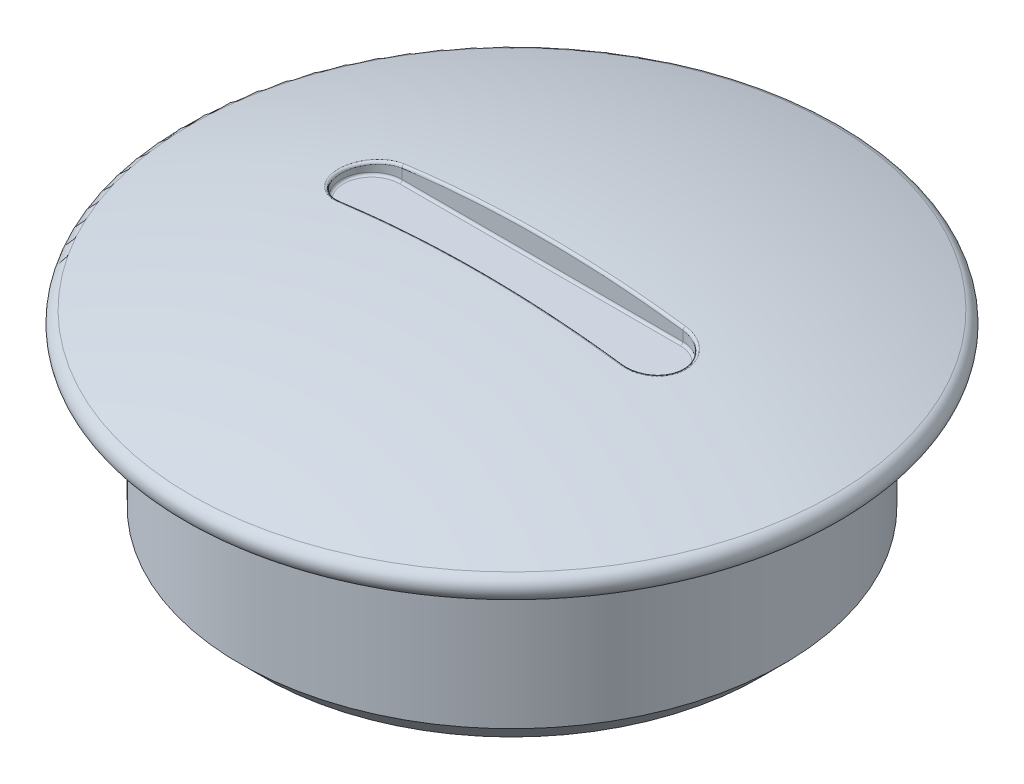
ISO-10303-21;
HEADER;
FILE_DESCRIPTION(('STEP AP214'),'2;1');
FILE_NAME('part.step','',(''),(''),'','','');
FILE_SCHEMA(('AUTOMOTIVE_DESIGN { 1 0 10303 214 1 1 1 1 }'));
ENDSEC;
DATA;
#1=APPLICATION_CONTEXT('core data for automotive mechanical design processes');
#2=APPLICATION_PROTOCOL_DEFINITION('international standard','automotive_design',2000,#1);
#3=PRODUCT_CONTEXT('',#1,'mechanical');
#4=PRODUCT('Part','Part','',(#3));
#5=PRODUCT_RELATED_PRODUCT_CATEGORY('part','',(#4));
#6=PRODUCT_DEFINITION_FORMATION('','',#4);
#7=PRODUCT_DEFINITION_CONTEXT('part definition',#1,'design');
#8=PRODUCT_DEFINITION('design','',#6,#7);
#9=PRODUCT_DEFINITION_SHAPE('','',#8);
#10=(LENGTH_UNIT() NAMED_UNIT(*) SI_UNIT(.MILLI.,.METRE.));
#11=(NAMED_UNIT(*) PLANE_ANGLE_UNIT() SI_UNIT($,.RADIAN.));
#12=(NAMED_UNIT(*) SI_UNIT($,.STERADIAN.) SOLID_ANGLE_UNIT());
#13=UNCERTAINTY_MEASURE_WITH_UNIT(LENGTH_MEASURE(1.E-05),#10,'distance_accuracy_value','');
#14=(GEOMETRIC_REPRESENTATION_CONTEXT(3) GLOBAL_UNCERTAINTY_ASSIGNED_CONTEXT((#13)) GLOBAL_UNIT_ASSIGNED_CONTEXT((#10,
#11,#12)) REPRESENTATION_CONTEXT('',''));
#15=CARTESIAN_POINT('',(0.,0.,0.));
#16=DIRECTION('',(0.,0.,1.));
#17=DIRECTION('',(1.,0.,0.));
#18=AXIS2_PLACEMENT_3D('',#15,#16,#17);
#19=CARTESIAN_POINT('',(0.,-9.31857288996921,0.));
#20=DIRECTION('',(0.,-1.,0.));
#21=DIRECTION('',(0.,0.,-1.));
#22=AXIS2_PLACEMENT_3D('',#19,#20,#21);
#23=CYLINDRICAL_SURFACE('',#22,11.15);
#24=CARTESIAN_POINT('',(0.,-5.99999999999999,0.));
#25=DIRECTION('',(0.,-1.,0.));
#26=DIRECTION('',(0.,0.,-1.));
#27=AXIS2_PLACEMENT_3D('',#24,#25,#26);
#28=CIRCLE('',#27,11.15);
#29=CARTESIAN_POINT('',(0.,-5.99999999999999,-11.15));
#30=VERTEX_POINT('',#29);
#31=EDGE_CURVE('E11',#30,#30,#28,.F.);
#32=ORIENTED_EDGE('',*,*,#31,.T.);
#33=EDGE_LOOP('',(#32));
#34=FACE_BOUND('',#33,.T.);
#35=CARTESIAN_POINT('',(0.,0.,0.));
#36=DIRECTION('',(0.,-1.,0.));
#37=DIRECTION('',(0.,0.,-1.));
#38=AXIS2_PLACEMENT_3D('',#35,#36,#37);
#39=CIRCLE('',#38,11.15);
#40=CARTESIAN_POINT('',(0.,0.,-11.15));
#41=VERTEX_POINT('',#40);
#42=EDGE_CURVE('E278',#41,#41,#39,.T.);
#43=ORIENTED_EDGE('',*,*,#42,.T.);
#44=EDGE_LOOP('',(#43));
#45=FACE_BOUND('',#44,.T.);
#46=ADVANCED_FACE('F34',(#34,#45),#23,.T.);
#47=CARTESIAN_POINT('',(11.15,-7.,0.));
#48=DIRECTION('',(0.,-1.,0.));
#49=DIRECTION('',(0.,0.,-1.));
#50=AXIS2_PLACEMENT_3D('',#47,#48,#49);
#51=PLANE('',#50);
#52=CARTESIAN_POINT('',(0.,-7.,0.));
#53=DIRECTION('',(0.,-1.,0.));
#54=DIRECTION('',(0.,0.,-1.));
#55=AXIS2_PLACEMENT_3D('',#52,#53,#54);
#56=CIRCLE('',#55,10.15);
#57=CARTESIAN_POINT('',(0.,-7.,-10.15));
#58=VERTEX_POINT('',#57);
#59=EDGE_CURVE('E43',#58,#58,#56,.T.);
#60=ORIENTED_EDGE('',*,*,#59,.T.);
#61=EDGE_LOOP('',(#60));
#62=FACE_BOUND('',#61,.T.);
#63=CARTESIAN_POINT('',(0.,-7.,0.));
#64=DIRECTION('',(0.,-1.,0.));
#65=DIRECTION('',(0.,0.,-1.));
#66=AXIS2_PLACEMENT_3D('',#63,#64,#65);
#67=CIRCLE('',#66,9.15);
#68=CARTESIAN_POINT('',(0.,-7.,-9.15));
#69=VERTEX_POINT('',#68);
#70=EDGE_CURVE('E123',#69,#69,#67,.T.);
#71=ORIENTED_EDGE('',*,*,#70,.F.);
#72=EDGE_LOOP('',(#71));
#73=FACE_BOUND('',#72,.T.);
#74=ADVANCED_FACE('F226',(#62,#73),#51,.T.);
#75=CARTESIAN_POINT('',(0.,-9.31857288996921,0.));
#76=DIRECTION('',(0.,-1.,0.));
#77=DIRECTION('',(0.,0.,-1.));
#78=AXIS2_PLACEMENT_3D('',#75,#76,#77);
#79=CYLINDRICAL_SURFACE('',#78,9.15);
#80=ORIENTED_EDGE('',*,*,#70,.T.);
#81=EDGE_LOOP('',(#80));
#82=FACE_BOUND('',#81,.T.);
#83=CARTESIAN_POINT('',(0.,-0.500000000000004,0.));
#84=DIRECTION('',(0.,-1.,0.));
#85=DIRECTION('',(0.,0.,-1.));
#86=AXIS2_PLACEMENT_3D('',#83,#84,#85);
#87=CIRCLE('',#86,9.15);
#88=CARTESIAN_POINT('',(0.,-0.500000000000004,-9.15));
#89=VERTEX_POINT('',#88);
#90=EDGE_CURVE('E253',#89,#89,#87,.T.);
#91=ORIENTED_EDGE('',*,*,#90,.F.);
#92=EDGE_LOOP('',(#91));
#93=FACE_BOUND('',#92,.T.);
#94=ADVANCED_FACE('F231',(#82,#93),#79,.F.);
#95=CARTESIAN_POINT('',(0.,-0.5,0.));
#96=DIRECTION('',(0.,-1.,0.));
#97=DIRECTION('',(0.,0.,-1.));
#98=AXIS2_PLACEMENT_3D('',#95,#96,#97);
#99=TOROIDAL_SURFACE('',#98,8.65,0.5);
#100=ORIENTED_EDGE('',*,*,#90,.T.);
#101=EDGE_LOOP('',(#100));
#102=FACE_BOUND('',#101,.T.);
#103=CARTESIAN_POINT('',(0.,0.,0.));
#104=DIRECTION('',(0.,-1.,0.));
#105=DIRECTION('',(0.,0.,-1.));
#106=AXIS2_PLACEMENT_3D('',#103,#104,#105);
#107=CIRCLE('',#106,8.65);
#108=CARTESIAN_POINT('',(0.,0.,-8.65));
#109=VERTEX_POINT('',#108);
#110=EDGE_CURVE('E251',#109,#109,#107,.T.);
#111=ORIENTED_EDGE('',*,*,#110,.F.);
#112=EDGE_LOOP('',(#111));
#113=FACE_BOUND('',#112,.T.);
#114=ADVANCED_FACE('F238',(#102,#113),#99,.F.);
#115=CARTESIAN_POINT('',(8.65,0.,0.));
#116=DIRECTION('',(0.,-1.,0.));
#117=DIRECTION('',(0.,0.,-1.));
#118=AXIS2_PLACEMENT_3D('',#115,#116,#117);
#119=PLANE('',#118);
#120=ORIENTED_EDGE('',*,*,#110,.T.);
#121=EDGE_LOOP('',(#120));
#122=FACE_BOUND('',#121,.T.);
#123=ADVANCED_FACE('F241',(#122),#119,.T.);
#124=CARTESIAN_POINT('',(0.,-40.75,0.));
#125=DIRECTION('',(0.,-1.,0.));
#126=DIRECTION('',(1.,0.,0.));
#127=AXIS2_PLACEMENT_3D('',#124,#125,#126);
#128=SPHERICAL_SURFACE('',#127,43.75);
#129=CARTESIAN_POINT('',(0.,-40.75,1.35309278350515));
#130=DIRECTION('',(0.,0.,-1.));
#131=DIRECTION('',(-1.,0.,0.));
#132=AXIS2_PLACEMENT_3D('',#129,#130,#131);
#133=CIRCLE('',#132,43.7290708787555);
#134=CARTESIAN_POINT('',(5.76317296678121,2.59763519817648,1.35309278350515));
#135=VERTEX_POINT('',#134);
#136=CARTESIAN_POINT('',(-5.76317296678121,2.59763519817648,1.35309278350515));
#137=VERTEX_POINT('',#136);
#138=EDGE_CURVE('E335',#135,#137,#133,.F.);
#139=ORIENTED_EDGE('',*,*,#138,.T.);
#140=CARTESIAN_POINT('',(-5.33350736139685,2.5583171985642,1.17857281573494));
#141=CARTESIAN_POINT('',(-5.34506801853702,2.65626465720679,1.18265820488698));
#142=CARTESIAN_POINT('',(-5.31233041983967,2.65753442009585,1.27577469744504));
#143=CARTESIAN_POINT('',(-5.40029053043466,2.54874126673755,1.20223363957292));
#144=CARTESIAN_POINT('',(-5.412663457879,2.64731194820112,1.20586744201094));
#145=CARTESIAN_POINT('',(-5.38462147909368,2.64793655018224,1.30138692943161));
#146=CARTESIAN_POINT('',(-5.46906613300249,2.53887619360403,1.22009251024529));
#147=CARTESIAN_POINT('',(-5.4818972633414,2.63813928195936,1.22304293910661));
#148=CARTESIAN_POINT('',(-5.45906929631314,2.6380488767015,1.32071869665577));
#149=CARTESIAN_POINT('',(-5.60856185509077,2.51886014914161,1.24396957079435));
#150=CARTESIAN_POINT('',(-5.62206823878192,2.61956244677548,1.24552801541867));
#151=CARTESIAN_POINT('',(-5.61006982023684,2.61798697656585,1.34656499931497));
#152=CARTESIAN_POINT('',(-5.67928060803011,2.508709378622,1.24999587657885));
#153=CARTESIAN_POINT('',(-5.69303833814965,2.61015387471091,1.2507606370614));
#154=CARTESIAN_POINT('',(-5.68662104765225,2.60781295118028,1.35308832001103));
#155=CARTESIAN_POINT('',(-5.82075662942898,2.48839505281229,1.25000412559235));
#156=CARTESIAN_POINT('',(-5.83473069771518,2.59136357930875,1.24923308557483));
#157=CARTESIAN_POINT('',(-5.83976519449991,2.58745208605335,1.35309724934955));
#158=CARTESIAN_POINT('',(-5.89151389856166,2.47823149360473,1.24397972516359));
#159=CARTESIAN_POINT('',(-5.90545674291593,2.58198130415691,1.24237346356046));
#160=CARTESIAN_POINT('',(-5.91635811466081,2.57726524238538,1.34657599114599));
#161=CARTESIAN_POINT('',(-6.03101316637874,2.45818691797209,1.22005576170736));
#162=CARTESIAN_POINT('',(-6.0446418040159,2.56351181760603,1.21692800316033));
#163=CARTESIAN_POINT('',(-6.06736247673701,2.55717474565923,1.32067891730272));
#164=CARTESIAN_POINT('',(-6.0997555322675,2.4483058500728,1.20215837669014));
#165=CARTESIAN_POINT('',(-6.11307446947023,2.5544280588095,1.19825425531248));
#166=CARTESIAN_POINT('',(-6.14177431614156,2.54727104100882,1.30130545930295));
#167=CARTESIAN_POINT('',(-6.23330224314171,2.42910349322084,1.15496163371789));
#168=CARTESIAN_POINT('',(-6.24580273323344,2.53680461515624,1.14973447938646));
#169=CARTESIAN_POINT('',(-6.28633518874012,2.52802469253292,1.25021620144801));
#170=CARTESIAN_POINT('',(-6.29810554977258,2.41978235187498,1.1256592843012));
#171=CARTESIAN_POINT('',(-6.3100409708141,2.52827250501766,1.11980883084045));
#172=CARTESIAN_POINT('',(-6.35648309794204,2.51868219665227,1.21849716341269));
#173=CARTESIAN_POINT('',(-6.42189100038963,2.4019720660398,1.05645171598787));
#174=CARTESIAN_POINT('',(-6.43258128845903,2.51199247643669,1.049646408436));
#175=CARTESIAN_POINT('',(-6.49047765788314,2.50083110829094,1.14358175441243));
#176=CARTESIAN_POINT('',(-6.48087307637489,2.39348293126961,1.01654637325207));
#177=CARTESIAN_POINT('',(-6.49080319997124,2.50425517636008,1.00935583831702));
#178=CARTESIAN_POINT('',(-6.55432423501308,2.49232252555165,1.1003852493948));
#179=CARTESIAN_POINT('',(-6.5910734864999,2.37761795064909,0.927414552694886));
#180=CARTESIAN_POINT('',(-6.59947381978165,2.48981031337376,0.919776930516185));
#181=CARTESIAN_POINT('',(-6.6736133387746,2.47642119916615,1.00390235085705));
#182=CARTESIAN_POINT('',(-6.64232154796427,2.37023784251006,0.878225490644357));
#183=CARTESIAN_POINT('',(-6.6498591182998,2.4831111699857,0.870500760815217));
#184=CARTESIAN_POINT('',(-6.72908804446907,2.46902418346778,0.950656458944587));
#185=CARTESIAN_POINT('',(-6.73581688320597,2.35677092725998,0.771803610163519));
#186=CARTESIAN_POINT('',(-6.7417293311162,2.47089400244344,0.764214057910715));
#187=CARTESIAN_POINT('',(-6.83029433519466,2.45552641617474,0.835457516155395));
#188=CARTESIAN_POINT('',(-6.7780650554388,2.35068399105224,0.714571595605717));
#189=CARTESIAN_POINT('',(-6.78311644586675,2.46538897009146,0.707215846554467));
#190=CARTESIAN_POINT('',(-6.8760268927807,2.44942553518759,0.773505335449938));
#191=CARTESIAN_POINT('',(-6.85198901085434,2.34003161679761,0.594195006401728));
#192=CARTESIAN_POINT('',(-6.85552897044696,2.45575580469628,0.587563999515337));
#193=CARTESIAN_POINT('',(-6.95604766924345,2.43874875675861,0.643200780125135));
#194=CARTESIAN_POINT('',(-6.88374979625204,2.33545394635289,0.531103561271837));
#195=CARTESIAN_POINT('',(-6.88654984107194,2.45162828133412,0.525004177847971));
#196=CARTESIAN_POINT('',(-6.99042790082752,2.43416059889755,0.574905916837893));
#197=CARTESIAN_POINT('',(-6.93622572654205,2.32788981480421,0.400407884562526));
#198=CARTESIAN_POINT('',(-6.93782871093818,2.44480468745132,0.395538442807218));
#199=CARTESIAN_POINT('',(-7.04723174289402,2.42657913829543,0.433431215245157));
#200=CARTESIAN_POINT('',(-6.95694156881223,2.32490325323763,0.332803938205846));
#201=CARTESIAN_POINT('',(-6.95801722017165,2.4421178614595,0.328706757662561));
#202=CARTESIAN_POINT('',(-7.06965610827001,2.42358573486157,0.360251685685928));
#203=CARTESIAN_POINT('',(-6.98658501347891,2.32062942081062,0.19556916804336));
#204=CARTESIAN_POINT('',(-6.98693669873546,2.43826890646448,0.193063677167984));
#205=CARTESIAN_POINT('',(-7.10174437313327,2.41930211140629,0.211698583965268));
#206=CARTESIAN_POINT('',(-6.99560341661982,2.31932906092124,0.125958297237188));
#207=CARTESIAN_POINT('',(-6.99571450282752,2.43710054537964,0.124363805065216));
#208=CARTESIAN_POINT('',(-7.11150656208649,2.41799877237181,0.136346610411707));
#209=CARTESIAN_POINT('',(-7.00187941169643,2.31842414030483,-0.0137998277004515));
#210=CARTESIAN_POINT('',(-7.00183285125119,2.43628617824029,-0.0136425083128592));
#211=CARTESIAN_POINT('',(-7.11830016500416,2.41709177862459,-0.0149379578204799));
#212=CARTESIAN_POINT('',(-6.99913739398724,2.31881952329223,-0.0839470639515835));
#213=CARTESIAN_POINT('',(-6.99916473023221,2.43664132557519,-0.0828470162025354));
#214=CARTESIAN_POINT('',(-7.11533200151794,2.41748806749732,-0.0908705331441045));
#215=CARTESIAN_POINT('',(-6.98200873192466,2.32128919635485,-0.222506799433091));
#216=CARTESIAN_POINT('',(-6.98246260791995,2.43886436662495,-0.219709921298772));
#217=CARTESIAN_POINT('',(-7.09679066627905,2.4199633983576,-0.240857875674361));
#218=CARTESIAN_POINT('',(-6.96766633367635,2.32335710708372,-0.290924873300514));
#219=CARTESIAN_POINT('',(-6.96849611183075,2.4407232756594,-0.287274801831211));
#220=CARTESIAN_POINT('',(-7.08126538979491,2.42203604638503,-0.314918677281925));
#221=CARTESIAN_POINT('',(-6.92781994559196,2.32910148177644,-0.424369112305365));
#222=CARTESIAN_POINT('',(-6.92959751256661,2.44590001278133,-0.419285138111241));
#223=CARTESIAN_POINT('',(-7.03813270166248,2.42779358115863,-0.459368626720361));
#224=CARTESIAN_POINT('',(-6.90231567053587,2.33277798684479,-0.489395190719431));
#225=CARTESIAN_POINT('',(-6.90471926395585,2.44921067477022,-0.483646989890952));
#226=CARTESIAN_POINT('',(-7.01052498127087,2.43147850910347,-0.529757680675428));
#227=CARTESIAN_POINT('',(-6.8408383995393,2.34163847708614,-0.614352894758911));
#228=CARTESIAN_POINT('',(-6.84458468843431,2.4572117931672,-0.607599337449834));
#229=CARTESIAN_POINT('',(-6.94397741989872,2.44035929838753,-0.665021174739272));
#230=CARTESIAN_POINT('',(-6.80484536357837,2.3468253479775,-0.67427448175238));
#231=CARTESIAN_POINT('',(-6.80938567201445,2.4618946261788,-0.667120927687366));
#232=CARTESIAN_POINT('',(-6.90501588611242,2.44555805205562,-0.729884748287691));
#233=CARTESIAN_POINT('',(-6.72346342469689,2.35855041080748,-0.787219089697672));
#234=CARTESIAN_POINT('',(-6.72956450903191,2.47251180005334,-0.7795999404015));
#235=CARTESIAN_POINT('',(-6.81692203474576,2.45730997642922,-0.852144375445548));
#236=CARTESIAN_POINT('',(-6.67807495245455,2.3650885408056,-0.840242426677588));
#237=CARTESIAN_POINT('',(-6.68503355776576,2.47843402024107,-0.832527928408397));
#238=CARTESIAN_POINT('',(-6.76779018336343,2.46386308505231,-0.909540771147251));
#239=CARTESIAN_POINT('',(-6.57886875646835,2.37937515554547,-0.938281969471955));
#240=CARTESIAN_POINT('',(-6.58741385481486,2.49141347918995,-0.930675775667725));
#241=CARTESIAN_POINT('',(-6.66040203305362,2.47818242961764,-1.01566604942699));
#242=CARTESIAN_POINT('',(-6.52499604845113,2.38713153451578,-0.983241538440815));
#243=CARTESIAN_POINT('',(-6.53436192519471,2.49846581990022,-0.975845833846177));
#244=CARTESIAN_POINT('',(-6.60208621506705,2.48595657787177,-1.06433362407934));
#245=CARTESIAN_POINT('',(-6.41058727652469,2.40359861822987,-1.06348768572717));
#246=CARTESIAN_POINT('',(-6.4213675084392,2.5134824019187,-1.05674728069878));
#247=CARTESIAN_POINT('',(-6.47824166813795,2.5024613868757,-1.15119801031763));
#248=CARTESIAN_POINT('',(-6.35005128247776,2.41230931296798,-1.09877436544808));
#249=CARTESIAN_POINT('',(-6.36151151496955,2.52143517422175,-1.09251319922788));
#250=CARTESIAN_POINT('',(-6.41271301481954,2.51119203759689,-1.18939493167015));
#251=CARTESIAN_POINT('',(-6.22342588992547,2.43052378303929,-1.15902262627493));
#252=CARTESIAN_POINT('',(-6.23597330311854,2.53810989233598,-1.15386319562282));
#253=CARTESIAN_POINT('',(-6.275644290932,2.52944823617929,-1.25461212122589));
#254=CARTESIAN_POINT('',(-6.15728910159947,2.44003432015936,-1.18388269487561));
#255=CARTESIAN_POINT('',(-6.17030661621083,2.54682976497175,-1.17941142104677));
#256=CARTESIAN_POINT('',(-6.20405292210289,2.53898056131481,-1.28152250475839));
#257=CARTESIAN_POINT('',(-6.0219218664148,2.45949345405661,-1.22208332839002));
#258=CARTESIAN_POINT('',(-6.03556486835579,2.56471645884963,-1.21902225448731));
#259=CARTESIAN_POINT('',(-6.05752137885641,2.55848427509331,-1.32287370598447));
#260=CARTESIAN_POINT('',(-5.95269718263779,2.46944123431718,-1.23544447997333));
#261=CARTESIAN_POINT('',(-5.96654199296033,2.5738764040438,-1.23318627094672));
#262=CARTESIAN_POINT('',(-5.98258744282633,2.56845484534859,-1.33733680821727));
#263=CARTESIAN_POINT('',(-5.83876559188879,2.48580775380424,-1.24763871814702));
#264=CARTESIAN_POINT('',(-5.85254844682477,2.5889995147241,-1.24665370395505));
#265=CARTESIAN_POINT('',(-5.8592594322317,2.58485885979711,-1.35053675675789));
#266=CARTESIAN_POINT('',(-5.79439397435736,2.49218042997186,-1.25000570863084));
#267=CARTESIAN_POINT('',(-5.80816313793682,2.59488679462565,-1.2495223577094));
#268=CARTESIAN_POINT('',(-5.81122829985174,2.59124613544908,-1.35309896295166));
#269=CARTESIAN_POINT('',(-5.67955380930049,2.50867014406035,-1.24999094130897));
#270=CARTESIAN_POINT('',(-5.69330818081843,2.61011808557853,-1.25075322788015));
#271=CARTESIAN_POINT('',(-5.68691678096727,2.60777362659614,-1.35308297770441));
#272=CARTESIAN_POINT('',(-5.60905132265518,2.51878988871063,-1.24400727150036));
#273=CARTESIAN_POINT('',(-5.62255655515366,2.61949770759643,-1.24556036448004));
#274=CARTESIAN_POINT('',(-5.61059965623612,2.6179165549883,-1.34660580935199));
#275=CARTESIAN_POINT('',(-5.46950451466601,2.53881331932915,-1.22021387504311));
#276=CARTESIAN_POINT('',(-5.48234186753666,2.63808038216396,-1.22316017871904));
#277=CARTESIAN_POINT('',(-5.4595438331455,2.63798585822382,-1.32085007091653));
#278=CARTESIAN_POINT('',(-5.40047470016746,2.54871487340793,-1.20231764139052));
#279=CARTESIAN_POINT('',(-5.41285430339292,2.64728668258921,-1.20595019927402));
#280=CARTESIAN_POINT('',(-5.38482083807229,2.64791009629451,-1.30147785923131));
#281=CARTESIAN_POINT('',(-5.33350736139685,2.55831719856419,-1.17857281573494));
#282=CARTESIAN_POINT('',(-5.34506801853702,2.65626465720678,-1.18265820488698));
#283=CARTESIAN_POINT('',(-5.31233041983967,2.65753442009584,-1.27577469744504));
#284=(BOUNDED_SURFACE() B_SPLINE_SURFACE(3,2,((#140,#141,#142),(#143,#144,#145),(#146,#147,
#148),(#149,#150,#151),(#152,#153,#154),(#155,#156,#157),(#158,#159,#160),(#161,#162,#163),
(#164,#165,#166),(#167,#168,#169),(#170,#171,#172),(#173,#174,#175),(#176,#177,#178),(#179,#180,
#181),(#182,#183,#184),(#185,#186,#187),(#188,#189,#190),(#191,#192,#193),(#194,#195,#196),
(#197,#198,#199),(#200,#201,#202),(#203,#204,#205),(#206,#207,#208),(#209,#210,#211),(#212,#213,
#214),(#215,#216,#217),(#218,#219,#220),(#221,#222,#223),(#224,#225,#226),(#227,#228,#229),
(#230,#231,#232),(#233,#234,#235),(#236,#237,#238),(#239,#240,#241),(#242,#243,#244),(#245,#246,
#247),(#248,#249,#250),(#251,#252,#253),(#254,#255,#256),(#257,#258,#259),(#260,#261,#262),
(#263,#264,#265),(#266,#267,#268),(#269,#270,#271),(#272,#273,#274),(#275,#276,#277),(#278,#279,
#280),(#281,#282,#283)),.UNSPECIFIED.,.F.,.F.,.F.) B_SPLINE_SURFACE_WITH_KNOTS((4,2,2,2,2,2,2,2,
2,2,2,2,2,2,2,2,2,2,2,2,2,2,2,4),(3,3),(0.,0.231035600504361,0.461912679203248,0.69291132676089,
0.92386761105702,1.15488451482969,1.38590411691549,1.61601179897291,1.84609649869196,
2.07426772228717,2.30242453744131,2.52879948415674,2.75516691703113,2.98067498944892,
3.20618882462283,3.43213638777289,3.65807359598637,3.8855403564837,4.11300473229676,
4.342634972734,4.5718532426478,4.71686557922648,4.94697713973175,5.17877823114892),(0.,1.),
.UNSPECIFIED.) GEOMETRIC_REPRESENTATION_ITEM() RATIONAL_B_SPLINE_SURFACE(((1.,0.711675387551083,
1.),(1.,0.709203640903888,1.),(1.,0.706644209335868,1.),(1.,0.701423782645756,1.),(1.,
0.698762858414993,1.),(1.,0.693408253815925,1.),(1.,0.690714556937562,1.),(1.,0.685372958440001,
1.),(1.,0.682725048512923,1.),(1.,0.677551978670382,1.),(1.,0.675026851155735,1.),(1.,
0.670178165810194,1.),(1.,0.667854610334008,1.),(1.,0.663493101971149,1.),(1.,0.661454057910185,
1.),(1.,0.657719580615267,1.),(1.,0.656024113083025,1.),(1.,0.653048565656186,1.),(1.,
0.651765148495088,1.),(1.,0.64964049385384,1.),(1.,0.648799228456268,1.),(1.,0.647594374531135,
1.),(1.,0.64722710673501,1.),(1.,0.646971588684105,1.),(1.,0.647083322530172,1.),(1.,
0.647780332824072,1.),(1.,0.648363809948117,1.),(1.,0.649980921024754,1.),(1.,0.651014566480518,
1.),(1.,0.653497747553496,1.),(1.,0.654948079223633,1.),(1.,0.658213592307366,1.),(1.,
0.660028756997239,1.),(1.,0.663976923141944,1.),(1.,0.666111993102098,1.),(1.,0.670621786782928,
1.),(1.,0.672996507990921,1.),(1.,0.677935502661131,1.),(1.,0.680501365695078,1.),(1.,
0.685722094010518,1.),(1.,0.68837679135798,1.),(1.,0.692720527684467,1.),(1.,0.694406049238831,
1.),(1.,0.698752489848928,1.),(1.,0.701405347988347,1.),(1.,0.706627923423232,1.),(1.,
0.709196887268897,1.),(1.,0.711675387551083,1.))) REPRESENTATION_ITEM('') SURFACE());
#285=CARTESIAN_POINT('',(-5.31233041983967,2.65753442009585,1.27577469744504));
#286=CARTESIAN_POINT('',(-5.38462147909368,2.64793655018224,1.30138692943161));
#287=CARTESIAN_POINT('',(-5.45906929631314,2.6380488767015,1.32071869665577));
#288=CARTESIAN_POINT('',(-5.61006982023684,2.61798697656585,1.34656499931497));
#289=CARTESIAN_POINT('',(-5.68662104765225,2.60781295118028,1.35308832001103));
#290=CARTESIAN_POINT('',(-5.83976519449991,2.58745208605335,1.35309724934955));
#291=CARTESIAN_POINT('',(-5.91635811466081,2.57726524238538,1.34657599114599));
#292=CARTESIAN_POINT('',(-6.06736247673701,2.55717474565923,1.32067891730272));
#293=CARTESIAN_POINT('',(-6.14177431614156,2.54727104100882,1.30130545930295));
#294=CARTESIAN_POINT('',(-6.28633518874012,2.52802469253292,1.25021620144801));
#295=CARTESIAN_POINT('',(-6.35648309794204,2.51868219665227,1.21849716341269));
#296=CARTESIAN_POINT('',(-6.49047765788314,2.50083110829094,1.14358175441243));
#297=CARTESIAN_POINT('',(-6.55432423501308,2.49232252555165,1.1003852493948));
#298=CARTESIAN_POINT('',(-6.6736133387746,2.47642119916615,1.00390235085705));
#299=CARTESIAN_POINT('',(-6.72908804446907,2.46902418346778,0.950656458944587));
#300=CARTESIAN_POINT('',(-6.83029433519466,2.45552641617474,0.835457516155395));
#301=CARTESIAN_POINT('',(-6.8760268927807,2.44942553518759,0.773505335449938));
#302=CARTESIAN_POINT('',(-6.95604766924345,2.43874875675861,0.643200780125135));
#303=CARTESIAN_POINT('',(-6.99042790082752,2.43416059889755,0.574905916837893));
#304=CARTESIAN_POINT('',(-7.04723174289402,2.42657913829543,0.433431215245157));
#305=CARTESIAN_POINT('',(-7.06965610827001,2.42358573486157,0.360251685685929));
#306=CARTESIAN_POINT('',(-7.10174437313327,2.41930211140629,0.211698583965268));
#307=CARTESIAN_POINT('',(-7.11150656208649,2.41799877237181,0.136346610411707));
#308=CARTESIAN_POINT('',(-7.11830016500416,2.41709177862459,-0.01493795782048));
#309=CARTESIAN_POINT('',(-7.11533200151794,2.41748806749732,-0.0908705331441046));
#310=CARTESIAN_POINT('',(-7.09679066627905,2.4199633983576,-0.240857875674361));
#311=CARTESIAN_POINT('',(-7.08126538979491,2.42203604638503,-0.314918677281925));
#312=CARTESIAN_POINT('',(-7.03813270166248,2.42779358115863,-0.459368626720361));
#313=CARTESIAN_POINT('',(-7.01052498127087,2.43147850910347,-0.529757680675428));
#314=CARTESIAN_POINT('',(-6.94397741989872,2.44035929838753,-0.665021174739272));
#315=CARTESIAN_POINT('',(-6.90501588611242,2.44555805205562,-0.729884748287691));
#316=CARTESIAN_POINT('',(-6.81692203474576,2.45730997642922,-0.852144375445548));
#317=CARTESIAN_POINT('',(-6.76779018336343,2.46386308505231,-0.909540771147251));
#318=CARTESIAN_POINT('',(-6.66040203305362,2.47818242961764,-1.01566604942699));
#319=CARTESIAN_POINT('',(-6.60208621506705,2.48595657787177,-1.06433362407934));
#320=CARTESIAN_POINT('',(-6.47824166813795,2.5024613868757,-1.15119801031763));
#321=CARTESIAN_POINT('',(-6.41271301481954,2.51119203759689,-1.18939493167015));
#322=CARTESIAN_POINT('',(-6.275644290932,2.52944823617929,-1.25461212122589));
#323=CARTESIAN_POINT('',(-6.20405292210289,2.53898056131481,-1.28152250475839));
#324=CARTESIAN_POINT('',(-6.05752137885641,2.55848427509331,-1.32287370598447));
#325=CARTESIAN_POINT('',(-5.98258744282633,2.56845484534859,-1.33733680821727));
#326=CARTESIAN_POINT('',(-5.8592594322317,2.58485885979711,-1.35053675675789));
#327=CARTESIAN_POINT('',(-5.81122829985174,2.59124613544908,-1.35309896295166));
#328=CARTESIAN_POINT('',(-5.68691678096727,2.60777362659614,-1.35308297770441));
#329=CARTESIAN_POINT('',(-5.61059965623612,2.6179165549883,-1.34660580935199));
#330=CARTESIAN_POINT('',(-5.4595438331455,2.63798585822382,-1.32085007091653));
#331=CARTESIAN_POINT('',(-5.38482083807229,2.64791009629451,-1.30147785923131));
#332=CARTESIAN_POINT('',(-5.31233041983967,2.65753442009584,-1.27577469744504));
#333=B_SPLINE_CURVE_WITH_KNOTS('',3,(#285,#286,#287,#288,#289,#290,#291,#292,#293,#294,#295,
#296,#297,#298,#299,#300,#301,#302,#303,#304,#305,#306,#307,#308,#309,#310,#311,#312,#313,#314,
#315,#316,#317,#318,#319,#320,#321,#322,#323,#324,#325,#326,#327,#328,#329,#330,#331,#332),
.UNSPECIFIED.,.F.,.F.,(4,2,2,2,2,2,2,2,2,2,2,2,2,2,2,2,2,2,2,2,2,2,2,4),(0.,0.231035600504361,
0.461912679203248,0.69291132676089,0.92386761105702,1.15488451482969,1.38590411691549,
1.61601179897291,1.84609649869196,2.07426772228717,2.30242453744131,2.52879948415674,
2.75516691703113,2.98067498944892,3.20618882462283,3.43213638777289,3.65807359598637,
3.8855403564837,4.11300473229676,4.342634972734,4.5718532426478,4.71686557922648,
4.94697713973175,5.17877823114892),.UNSPECIFIED.);
#334=CARTESIAN_POINT('',(-5.76317296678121,2.59763519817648,-1.35309278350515));
#335=VERTEX_POINT('',#334);
#336=EDGE_CURVE('E337',#137,#335,#333,.T.);
#337=ORIENTED_EDGE('',*,*,#336,.T.);
#338=CARTESIAN_POINT('',(0.,-40.75,-1.35309278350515));
#339=DIRECTION('',(0.,0.,1.));
#340=DIRECTION('',(1.,0.,0.));
#341=AXIS2_PLACEMENT_3D('',#338,#339,#340);
#342=CIRCLE('',#341,43.7290708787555);
#343=CARTESIAN_POINT('',(5.76317296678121,2.59763519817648,-1.35309278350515));
#344=VERTEX_POINT('',#343);
#345=EDGE_CURVE('E57',#335,#344,#342,.F.);
#346=ORIENTED_EDGE('',*,*,#345,.T.);
#347=CARTESIAN_POINT('',(5.33350736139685,2.5583171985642,-1.17857281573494));
#348=CARTESIAN_POINT('',(5.34506801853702,2.65626465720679,-1.18265820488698));
#349=CARTESIAN_POINT('',(5.31233041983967,2.65753442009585,-1.27577469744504));
#350=CARTESIAN_POINT('',(5.40029053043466,2.54874126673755,-1.20223363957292));
#351=CARTESIAN_POINT('',(5.412663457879,2.64731194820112,-1.20586744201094));
#352=CARTESIAN_POINT('',(5.38462147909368,2.64793655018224,-1.30138692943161));
#353=CARTESIAN_POINT('',(5.46906613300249,2.53887619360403,-1.22009251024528));
#354=CARTESIAN_POINT('',(5.4818972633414,2.63813928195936,-1.22304293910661));
#355=CARTESIAN_POINT('',(5.45906929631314,2.6380488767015,-1.32071869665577));
#356=CARTESIAN_POINT('',(5.60856185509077,2.51886014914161,-1.24396957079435));
#357=CARTESIAN_POINT('',(5.62206823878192,2.61956244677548,-1.24552801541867));
#358=CARTESIAN_POINT('',(5.61006982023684,2.61798697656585,-1.34656499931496));
#359=CARTESIAN_POINT('',(5.67928060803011,2.508709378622,-1.24999587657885));
#360=CARTESIAN_POINT('',(5.69303833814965,2.61015387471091,-1.2507606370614));
#361=CARTESIAN_POINT('',(5.68662104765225,2.60781295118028,-1.35308832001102));
#362=CARTESIAN_POINT('',(5.82075662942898,2.48839505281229,-1.25000412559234));
#363=CARTESIAN_POINT('',(5.83473069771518,2.59136357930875,-1.24923308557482));
#364=CARTESIAN_POINT('',(5.83976519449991,2.58745208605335,-1.35309724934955));
#365=CARTESIAN_POINT('',(5.89151389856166,2.47823149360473,-1.24397972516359));
#366=CARTESIAN_POINT('',(5.90545674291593,2.58198130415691,-1.24237346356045));
#367=CARTESIAN_POINT('',(5.91635811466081,2.57726524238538,-1.34657599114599));
#368=CARTESIAN_POINT('',(6.03101316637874,2.45818691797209,-1.22005576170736));
#369=CARTESIAN_POINT('',(6.0446418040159,2.56351181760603,-1.21692800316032));
#370=CARTESIAN_POINT('',(6.06736247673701,2.55717474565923,-1.32067891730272));
#371=CARTESIAN_POINT('',(6.0997555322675,2.4483058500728,-1.20215837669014));
#372=CARTESIAN_POINT('',(6.11307446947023,2.5544280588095,-1.19825425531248));
#373=CARTESIAN_POINT('',(6.14177431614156,2.54727104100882,-1.30130545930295));
#374=CARTESIAN_POINT('',(6.23330224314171,2.42910349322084,-1.15496163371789));
#375=CARTESIAN_POINT('',(6.24580273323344,2.53680461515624,-1.14973447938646));
#376=CARTESIAN_POINT('',(6.28633518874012,2.52802469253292,-1.25021620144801));
#377=CARTESIAN_POINT('',(6.29810554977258,2.41978235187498,-1.1256592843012));
#378=CARTESIAN_POINT('',(6.3100409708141,2.52827250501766,-1.11980883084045));
#379=CARTESIAN_POINT('',(6.35648309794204,2.51868219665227,-1.21849716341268));
#380=CARTESIAN_POINT('',(6.42189100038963,2.4019720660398,-1.05645171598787));
#381=CARTESIAN_POINT('',(6.43258128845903,2.51199247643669,-1.049646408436));
#382=CARTESIAN_POINT('',(6.49047765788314,2.50083110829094,-1.14358175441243));
#383=CARTESIAN_POINT('',(6.48087307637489,2.39348293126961,-1.01654637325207));
#384=CARTESIAN_POINT('',(6.49080319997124,2.50425517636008,-1.00935583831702));
#385=CARTESIAN_POINT('',(6.55432423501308,2.49232252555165,-1.1003852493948));
#386=CARTESIAN_POINT('',(6.5910734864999,2.37761795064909,-0.927414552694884));
#387=CARTESIAN_POINT('',(6.59947381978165,2.48981031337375,-0.919776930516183));
#388=CARTESIAN_POINT('',(6.6736133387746,2.47642119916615,-1.00390235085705));
#389=CARTESIAN_POINT('',(6.64232154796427,2.37023784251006,-0.878225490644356));
#390=CARTESIAN_POINT('',(6.6498591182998,2.4831111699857,-0.870500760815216));
#391=CARTESIAN_POINT('',(6.72908804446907,2.46902418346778,-0.950656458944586));
#392=CARTESIAN_POINT('',(6.73581688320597,2.35677092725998,-0.771803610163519));
#393=CARTESIAN_POINT('',(6.7417293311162,2.47089400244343,-0.764214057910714));
#394=CARTESIAN_POINT('',(6.83029433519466,2.45552641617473,-0.835457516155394));
#395=CARTESIAN_POINT('',(6.7780650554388,2.35068399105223,-0.714571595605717));
#396=CARTESIAN_POINT('',(6.78311644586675,2.46538897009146,-0.707215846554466));
#397=CARTESIAN_POINT('',(6.8760268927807,2.44942553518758,-0.773505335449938));
#398=CARTESIAN_POINT('',(6.85198901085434,2.34003161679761,-0.594195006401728));
#399=CARTESIAN_POINT('',(6.85552897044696,2.45575580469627,-0.587563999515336));
#400=CARTESIAN_POINT('',(6.95604766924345,2.4387487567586,-0.643200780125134));
#401=CARTESIAN_POINT('',(6.88374979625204,2.33545394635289,-0.531103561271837));
#402=CARTESIAN_POINT('',(6.88654984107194,2.45162828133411,-0.525004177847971));
#403=CARTESIAN_POINT('',(6.99042790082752,2.43416059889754,-0.574905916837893));
#404=CARTESIAN_POINT('',(6.93622572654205,2.32788981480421,-0.400407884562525));
#405=CARTESIAN_POINT('',(6.93782871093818,2.44480468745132,-0.395538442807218));
#406=CARTESIAN_POINT('',(7.04723174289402,2.42657913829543,-0.433431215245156));
#407=CARTESIAN_POINT('',(6.95694156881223,2.32490325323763,-0.332803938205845));
#408=CARTESIAN_POINT('',(6.95801722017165,2.4421178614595,-0.32870675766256));
#409=CARTESIAN_POINT('',(7.06965610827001,2.42358573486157,-0.360251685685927));
#410=CARTESIAN_POINT('',(6.98658501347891,2.32062942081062,-0.195569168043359));
#411=CARTESIAN_POINT('',(6.98693669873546,2.43826890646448,-0.193063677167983));
#412=CARTESIAN_POINT('',(7.10174437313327,2.41930211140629,-0.211698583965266));
#413=CARTESIAN_POINT('',(6.99560341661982,2.31932906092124,-0.125958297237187));
#414=CARTESIAN_POINT('',(6.99571450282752,2.43710054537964,-0.124363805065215));
#415=CARTESIAN_POINT('',(7.11150656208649,2.41799877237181,-0.136346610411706));
#416=CARTESIAN_POINT('',(7.00187941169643,2.31842414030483,0.0137998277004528));
#417=CARTESIAN_POINT('',(7.00183285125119,2.43628617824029,0.0136425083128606));
#418=CARTESIAN_POINT('',(7.11830016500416,2.41709177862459,0.0149379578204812));
#419=CARTESIAN_POINT('',(6.99913739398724,2.31881952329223,0.0839470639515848));
#420=CARTESIAN_POINT('',(6.99916473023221,2.43664132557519,0.0828470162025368));
#421=CARTESIAN_POINT('',(7.11533200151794,2.41748806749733,0.0908705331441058));
#422=CARTESIAN_POINT('',(6.98200873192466,2.32128919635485,0.222506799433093));
#423=CARTESIAN_POINT('',(6.98246260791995,2.43886436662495,0.219709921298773));
#424=CARTESIAN_POINT('',(7.09679066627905,2.4199633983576,0.240857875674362));
#425=CARTESIAN_POINT('',(6.96766633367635,2.32335710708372,0.290924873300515));
#426=CARTESIAN_POINT('',(6.96849611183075,2.4407232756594,0.287274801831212));
#427=CARTESIAN_POINT('',(7.08126538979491,2.42203604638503,0.314918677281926));
#428=CARTESIAN_POINT('',(6.92781994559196,2.32910148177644,0.424369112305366));
#429=CARTESIAN_POINT('',(6.92959751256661,2.44590001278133,0.419285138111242));
#430=CARTESIAN_POINT('',(7.03813270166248,2.42779358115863,0.459368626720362));
#431=CARTESIAN_POINT('',(6.90231567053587,2.33277798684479,0.489395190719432));
#432=CARTESIAN_POINT('',(6.90471926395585,2.44921067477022,0.483646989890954));
#433=CARTESIAN_POINT('',(7.01052498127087,2.43147850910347,0.529757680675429));
#434=CARTESIAN_POINT('',(6.8408383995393,2.34163847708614,0.614352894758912));
#435=CARTESIAN_POINT('',(6.84458468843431,2.4572117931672,0.607599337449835));
#436=CARTESIAN_POINT('',(6.94397741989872,2.44035929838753,0.665021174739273));
#437=CARTESIAN_POINT('',(6.80484536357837,2.3468253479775,0.674274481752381));
#438=CARTESIAN_POINT('',(6.80938567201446,2.4618946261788,0.667120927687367));
#439=CARTESIAN_POINT('',(6.90501588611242,2.44555805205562,0.729884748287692));
#440=CARTESIAN_POINT('',(6.72346342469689,2.35855041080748,0.787219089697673));
#441=CARTESIAN_POINT('',(6.72956450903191,2.47251180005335,0.779599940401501));
#442=CARTESIAN_POINT('',(6.81692203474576,2.45730997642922,0.852144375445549));
#443=CARTESIAN_POINT('',(6.67807495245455,2.3650885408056,0.840242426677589));
#444=CARTESIAN_POINT('',(6.68503355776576,2.47843402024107,0.832527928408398));
#445=CARTESIAN_POINT('',(6.76779018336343,2.46386308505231,0.909540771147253));
#446=CARTESIAN_POINT('',(6.57886875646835,2.37937515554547,0.938281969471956));
#447=CARTESIAN_POINT('',(6.58741385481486,2.49141347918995,0.930675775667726));
#448=CARTESIAN_POINT('',(6.66040203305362,2.47818242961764,1.01566604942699));
#449=CARTESIAN_POINT('',(6.52499604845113,2.38713153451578,0.983241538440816));
#450=CARTESIAN_POINT('',(6.5343619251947,2.49846581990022,0.975845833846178));
#451=CARTESIAN_POINT('',(6.60208621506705,2.48595657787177,1.06433362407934));
#452=CARTESIAN_POINT('',(6.41058727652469,2.40359861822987,1.06348768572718));
#453=CARTESIAN_POINT('',(6.4213675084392,2.51348240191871,1.05674728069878));
#454=CARTESIAN_POINT('',(6.47824166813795,2.5024613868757,1.15119801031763));
#455=CARTESIAN_POINT('',(6.35005128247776,2.41230931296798,1.09877436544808));
#456=CARTESIAN_POINT('',(6.36151151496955,2.52143517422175,1.09251319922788));
#457=CARTESIAN_POINT('',(6.41271301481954,2.51119203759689,1.18939493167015));
#458=CARTESIAN_POINT('',(6.22342588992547,2.43052378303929,1.15902262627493));
#459=CARTESIAN_POINT('',(6.23597330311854,2.53810989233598,1.15386319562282));
#460=CARTESIAN_POINT('',(6.275644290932,2.52944823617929,1.2546121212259));
#461=CARTESIAN_POINT('',(6.15728910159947,2.44003432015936,1.18388269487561));
#462=CARTESIAN_POINT('',(6.17030661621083,2.54682976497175,1.17941142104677));
#463=CARTESIAN_POINT('',(6.20405292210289,2.53898056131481,1.28152250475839));
#464=CARTESIAN_POINT('',(6.0219218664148,2.45949345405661,1.22208332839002));
#465=CARTESIAN_POINT('',(6.03556486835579,2.56471645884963,1.21902225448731));
#466=CARTESIAN_POINT('',(6.05752137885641,2.55848427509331,1.32287370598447));
#467=CARTESIAN_POINT('',(5.95269718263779,2.46944123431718,1.23544447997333));
#468=CARTESIAN_POINT('',(5.96654199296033,2.5738764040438,1.23318627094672));
#469=CARTESIAN_POINT('',(5.98258744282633,2.56845484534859,1.33733680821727));
#470=CARTESIAN_POINT('',(5.83876559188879,2.48580775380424,1.24763871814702));
#471=CARTESIAN_POINT('',(5.85254844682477,2.5889995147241,1.24665370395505));
#472=CARTESIAN_POINT('',(5.8592594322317,2.58485885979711,1.35053675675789));
#473=CARTESIAN_POINT('',(5.79439397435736,2.49218042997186,1.25000570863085));
#474=CARTESIAN_POINT('',(5.80816313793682,2.59488679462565,1.2495223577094));
#475=CARTESIAN_POINT('',(5.81122829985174,2.59124613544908,1.35309896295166));
#476=CARTESIAN_POINT('',(5.67955380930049,2.50867014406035,1.24999094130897));
#477=CARTESIAN_POINT('',(5.69330818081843,2.61011808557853,1.25075322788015));
#478=CARTESIAN_POINT('',(5.68691678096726,2.60777362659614,1.35308297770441));
#479=CARTESIAN_POINT('',(5.60905132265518,2.51878988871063,1.24400727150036));
#480=CARTESIAN_POINT('',(5.62255655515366,2.61949770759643,1.24556036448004));
#481=CARTESIAN_POINT('',(5.61059965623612,2.6179165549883,1.34660580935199));
#482=CARTESIAN_POINT('',(5.46950451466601,2.53881331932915,1.22021387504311));
#483=CARTESIAN_POINT('',(5.48234186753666,2.63808038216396,1.22316017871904));
#484=CARTESIAN_POINT('',(5.4595438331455,2.63798585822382,1.32085007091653));
#485=CARTESIAN_POINT('',(5.40047470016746,2.54871487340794,1.20231764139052));
#486=CARTESIAN_POINT('',(5.41285430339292,2.64728668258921,1.20595019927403));
#487=CARTESIAN_POINT('',(5.38482083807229,2.6479100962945,1.30147785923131));
#488=CARTESIAN_POINT('',(5.33350736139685,2.55831719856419,1.17857281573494));
#489=CARTESIAN_POINT('',(5.34506801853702,2.65626465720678,1.18265820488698));
#490=CARTESIAN_POINT('',(5.31233041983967,2.65753442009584,1.27577469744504));
#491=(BOUNDED_SURFACE() B_SPLINE_SURFACE(3,2,((#347,#348,#349),(#350,#351,#352),(#353,#354,
#355),(#356,#357,#358),(#359,#360,#361),(#362,#363,#364),(#365,#366,#367),(#368,#369,#370),
(#371,#372,#373),(#374,#375,#376),(#377,#378,#379),(#380,#381,#382),(#383,#384,#385),(#386,#387,
#388),(#389,#390,#391),(#392,#393,#394),(#395,#396,#397),(#398,#399,#400),(#401,#402,#403),
(#404,#405,#406),(#407,#408,#409),(#410,#411,#412),(#413,#414,#415),(#416,#417,#418),(#419,#420,
#421),(#422,#423,#424),(#425,#426,#427),(#428,#429,#430),(#431,#432,#433),(#434,#435,#436),
(#437,#438,#439),(#440,#441,#442),(#443,#444,#445),(#446,#447,#448),(#449,#450,#451),(#452,#453,
#454),(#455,#456,#457),(#458,#459,#460),(#461,#462,#463),(#464,#465,#466),(#467,#468,#469),
(#470,#471,#472),(#473,#474,#475),(#476,#477,#478),(#479,#480,#481),(#482,#483,#484),(#485,#486,
#487),(#488,#489,#490)),.UNSPECIFIED.,.F.,.F.,.F.) B_SPLINE_SURFACE_WITH_KNOTS((4,2,2,2,2,2,2,2,
2,2,2,2,2,2,2,2,2,2,2,2,2,2,2,4),(3,3),(0.,0.231035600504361,0.461912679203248,0.69291132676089,
0.92386761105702,1.15488451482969,1.38590411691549,1.61601179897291,1.84609649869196,
2.07426772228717,2.30242453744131,2.52879948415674,2.75516691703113,2.98067498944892,
3.20618882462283,3.43213638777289,3.65807359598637,3.8855403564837,4.11300473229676,
4.342634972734,4.5718532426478,4.71686557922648,4.94697713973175,5.17877823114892),(0.,1.),
.UNSPECIFIED.) GEOMETRIC_REPRESENTATION_ITEM() RATIONAL_B_SPLINE_SURFACE(((1.,0.711675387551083,
1.),(1.,0.709203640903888,1.),(1.,0.706644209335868,1.),(1.,0.701423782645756,1.),(1.,
0.698762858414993,1.),(1.,0.693408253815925,1.),(1.,0.690714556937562,1.),(1.,0.685372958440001,
1.),(1.,0.682725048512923,1.),(1.,0.677551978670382,1.),(1.,0.675026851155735,1.),(1.,
0.670178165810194,1.),(1.,0.667854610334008,1.),(1.,0.663493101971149,1.),(1.,0.661454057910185,
1.),(1.,0.657719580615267,1.),(1.,0.656024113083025,1.),(1.,0.653048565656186,1.),(1.,
0.651765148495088,1.),(1.,0.64964049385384,1.),(1.,0.648799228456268,1.),(1.,0.647594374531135,
1.),(1.,0.64722710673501,1.),(1.,0.646971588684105,1.),(1.,0.647083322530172,1.),(1.,
0.647780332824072,1.),(1.,0.648363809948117,1.),(1.,0.649980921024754,1.),(1.,0.651014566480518,
1.),(1.,0.653497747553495,1.),(1.,0.654948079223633,1.),(1.,0.658213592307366,1.),(1.,
0.660028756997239,1.),(1.,0.663976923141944,1.),(1.,0.666111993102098,1.),(1.,0.670621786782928,
1.),(1.,0.672996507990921,1.),(1.,0.677935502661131,1.),(1.,0.680501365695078,1.),(1.,
0.685722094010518,1.),(1.,0.68837679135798,1.),(1.,0.692720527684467,1.),(1.,0.694406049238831,
1.),(1.,0.698752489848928,1.),(1.,0.701405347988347,1.),(1.,0.706627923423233,1.),(1.,
0.709196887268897,1.),(1.,0.711675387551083,1.))) REPRESENTATION_ITEM('') SURFACE());
#492=CARTESIAN_POINT('',(5.31233041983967,2.65753442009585,-1.27577469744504));
#493=CARTESIAN_POINT('',(5.38462147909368,2.64793655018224,-1.30138692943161));
#494=CARTESIAN_POINT('',(5.45906929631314,2.6380488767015,-1.32071869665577));
#495=CARTESIAN_POINT('',(5.61006982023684,2.61798697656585,-1.34656499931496));
#496=CARTESIAN_POINT('',(5.68662104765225,2.60781295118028,-1.35308832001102));
#497=CARTESIAN_POINT('',(5.83976519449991,2.58745208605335,-1.35309724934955));
#498=CARTESIAN_POINT('',(5.91635811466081,2.57726524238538,-1.34657599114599));
#499=CARTESIAN_POINT('',(6.06736247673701,2.55717474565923,-1.32067891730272));
#500=CARTESIAN_POINT('',(6.14177431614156,2.54727104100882,-1.30130545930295));
#501=CARTESIAN_POINT('',(6.28633518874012,2.52802469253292,-1.25021620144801));
#502=CARTESIAN_POINT('',(6.35648309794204,2.51868219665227,-1.21849716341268));
#503=CARTESIAN_POINT('',(6.49047765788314,2.50083110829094,-1.14358175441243));
#504=CARTESIAN_POINT('',(6.55432423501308,2.49232252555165,-1.1003852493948));
#505=CARTESIAN_POINT('',(6.6736133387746,2.47642119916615,-1.00390235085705));
#506=CARTESIAN_POINT('',(6.72908804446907,2.46902418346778,-0.950656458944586));
#507=CARTESIAN_POINT('',(6.83029433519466,2.45552641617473,-0.835457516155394));
#508=CARTESIAN_POINT('',(6.8760268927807,2.44942553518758,-0.773505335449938));
#509=CARTESIAN_POINT('',(6.95604766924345,2.4387487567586,-0.643200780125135));
#510=CARTESIAN_POINT('',(6.99042790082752,2.43416059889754,-0.574905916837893));
#511=CARTESIAN_POINT('',(7.04723174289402,2.42657913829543,-0.433431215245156));
#512=CARTESIAN_POINT('',(7.06965610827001,2.42358573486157,-0.360251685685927));
#513=CARTESIAN_POINT('',(7.10174437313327,2.41930211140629,-0.211698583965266));
#514=CARTESIAN_POINT('',(7.11150656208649,2.41799877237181,-0.136346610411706));
#515=CARTESIAN_POINT('',(7.11830016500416,2.41709177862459,0.0149379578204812));
#516=CARTESIAN_POINT('',(7.11533200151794,2.41748806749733,0.090870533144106));
#517=CARTESIAN_POINT('',(7.09679066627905,2.4199633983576,0.240857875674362));
#518=CARTESIAN_POINT('',(7.08126538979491,2.42203604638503,0.314918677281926));
#519=CARTESIAN_POINT('',(7.03813270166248,2.42779358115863,0.459368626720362));
#520=CARTESIAN_POINT('',(7.01052498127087,2.43147850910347,0.529757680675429));
#521=CARTESIAN_POINT('',(6.94397741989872,2.44035929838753,0.665021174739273));
#522=CARTESIAN_POINT('',(6.90501588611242,2.44555805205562,0.729884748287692));
#523=CARTESIAN_POINT('',(6.81692203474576,2.45730997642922,0.852144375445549));
#524=CARTESIAN_POINT('',(6.76779018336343,2.46386308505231,0.909540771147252));
#525=CARTESIAN_POINT('',(6.66040203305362,2.47818242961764,1.01566604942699));
#526=CARTESIAN_POINT('',(6.60208621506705,2.48595657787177,1.06433362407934));
#527=CARTESIAN_POINT('',(6.47824166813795,2.5024613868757,1.15119801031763));
#528=CARTESIAN_POINT('',(6.41271301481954,2.51119203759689,1.18939493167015));
#529=CARTESIAN_POINT('',(6.275644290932,2.52944823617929,1.2546121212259));
#530=CARTESIAN_POINT('',(6.20405292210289,2.53898056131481,1.28152250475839));
#531=CARTESIAN_POINT('',(6.05752137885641,2.55848427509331,1.32287370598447));
#532=CARTESIAN_POINT('',(5.98258744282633,2.56845484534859,1.33733680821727));
#533=CARTESIAN_POINT('',(5.8592594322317,2.58485885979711,1.35053675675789));
#534=CARTESIAN_POINT('',(5.81122829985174,2.59124613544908,1.35309896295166));
#535=CARTESIAN_POINT('',(5.68691678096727,2.60777362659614,1.35308297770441));
#536=CARTESIAN_POINT('',(5.61059965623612,2.6179165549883,1.34660580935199));
#537=CARTESIAN_POINT('',(5.4595438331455,2.63798585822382,1.32085007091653));
#538=CARTESIAN_POINT('',(5.38482083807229,2.6479100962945,1.30147785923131));
#539=CARTESIAN_POINT('',(5.31233041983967,2.65753442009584,1.27577469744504));
#540=B_SPLINE_CURVE_WITH_KNOTS('',3,(#492,#493,#494,#495,#496,#497,#498,#499,#500,#501,#502,
#503,#504,#505,#506,#507,#508,#509,#510,#511,#512,#513,#514,#515,#516,#517,#518,#519,#520,#521,
#522,#523,#524,#525,#526,#527,#528,#529,#530,#531,#532,#533,#534,#535,#536,#537,#538,#539),
.UNSPECIFIED.,.F.,.F.,(4,2,2,2,2,2,2,2,2,2,2,2,2,2,2,2,2,2,2,2,2,2,2,4),(0.,0.231035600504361,
0.461912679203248,0.69291132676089,0.92386761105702,1.15488451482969,1.38590411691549,
1.61601179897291,1.84609649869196,2.07426772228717,2.30242453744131,2.52879948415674,
2.75516691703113,2.98067498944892,3.20618882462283,3.43213638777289,3.65807359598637,
3.8855403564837,4.11300473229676,4.342634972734,4.5718532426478,4.71686557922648,
4.94697713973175,5.17877823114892),.UNSPECIFIED.);
#541=EDGE_CURVE('E320',#344,#135,#540,.T.);
#542=ORIENTED_EDGE('',*,*,#541,.T.);
#543=EDGE_LOOP('',(#139,#337,#346,#542));
#544=FACE_BOUND('',#543,.T.);
#545=CARTESIAN_POINT('',(0.,0.976878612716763,0.));
#546=DIRECTION('',(0.,-1.,0.));
#547=DIRECTION('',(0.,0.,-1.));
#548=AXIS2_PLACEMENT_3D('',#545,#546,#547);
#549=CIRCLE('',#548,13.150289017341);
#550=CARTESIAN_POINT('',(0.,0.976878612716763,-13.150289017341));
#551=VERTEX_POINT('',#550);
#552=EDGE_CURVE('E254',#551,#551,#549,.T.);
#553=ORIENTED_EDGE('',*,*,#552,.F.);
#554=EDGE_LOOP('',(#553));
#555=FACE_BOUND('',#554,.T.);
#556=ADVANCED_FACE('F168',(#544,#555),#128,.T.);
#557=CARTESIAN_POINT('',(0.,0.5,0.));
#558=DIRECTION('',(0.,-1.,0.));
#559=DIRECTION('',(0.,0.,-1.));
#560=AXIS2_PLACEMENT_3D('',#557,#558,#559);
#561=TOROIDAL_SURFACE('',#560,13.,0.5);
#562=ORIENTED_EDGE('',*,*,#552,.T.);
#563=EDGE_LOOP('',(#562));
#564=FACE_BOUND('',#563,.T.);
#565=CARTESIAN_POINT('',(0.,0.,0.));
#566=DIRECTION('',(0.,-1.,0.));
#567=DIRECTION('',(0.,0.,-1.));
#568=AXIS2_PLACEMENT_3D('',#565,#566,#567);
#569=CIRCLE('',#568,13.);
#570=CARTESIAN_POINT('',(0.,0.,-13.));
#571=VERTEX_POINT('',#570);
#572=EDGE_CURVE('E259',#571,#571,#569,.T.);
#573=ORIENTED_EDGE('',*,*,#572,.F.);
#574=EDGE_LOOP('',(#573));
#575=FACE_BOUND('',#574,.T.);
#576=ADVANCED_FACE('F248',(#564,#575),#561,.T.);
#577=CARTESIAN_POINT('',(11.15,0.,0.));
#578=DIRECTION('',(0.,-1.,0.));
#579=DIRECTION('',(0.,0.,-1.));
#580=AXIS2_PLACEMENT_3D('',#577,#578,#579);
#581=PLANE('',#580);
#582=ORIENTED_EDGE('',*,*,#572,.T.);
#583=EDGE_LOOP('',(#582));
#584=FACE_BOUND('',#583,.T.);
#585=ORIENTED_EDGE('',*,*,#42,.F.);
#586=EDGE_LOOP('',(#585));
#587=FACE_BOUND('',#586,.T.);
#588=ADVANCED_FACE('F291',(#584,#587),#581,.T.);
#589=CARTESIAN_POINT('',(5.75,2.,0.));
#590=DIRECTION('',(0.,1.,0.));
#591=DIRECTION('',(0.,0.,1.));
#592=AXIS2_PLACEMENT_3D('',#589,#590,#591);
#593=CYLINDRICAL_SURFACE('',#592,1.25);
#594=DIRECTION('',(0.,1.,0.));
#595=VECTOR('',#594,1.);
#596=CARTESIAN_POINT('',(5.75,2.,-1.25));
#597=LINE('',#596,#595);
#598=CARTESIAN_POINT('',(5.75,2.1,-1.25));
#599=VERTEX_POINT('',#598);
#600=CARTESIAN_POINT('',(5.75,2.49855488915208,-1.25));
#601=VERTEX_POINT('',#600);
#602=EDGE_CURVE('E270',#599,#601,#597,.T.);
#603=ORIENTED_EDGE('',*,*,#602,.F.);
#604=CARTESIAN_POINT('',(5.75,2.1,0.));
#605=DIRECTION('',(0.,-1.,0.));
#606=DIRECTION('',(0.,0.,-1.));
#607=AXIS2_PLACEMENT_3D('',#604,#605,#606);
#608=CIRCLE('',#607,1.25);
#609=CARTESIAN_POINT('',(5.75,2.1,1.25));
#610=VERTEX_POINT('',#609);
#611=EDGE_CURVE('E268',#599,#610,#608,.T.);
#612=ORIENTED_EDGE('',*,*,#611,.T.);
#613=DIRECTION('',(0.,1.,0.));
#614=VECTOR('',#613,1.);
#615=CARTESIAN_POINT('',(5.75,2.,1.25));
#616=LINE('',#615,#614);
#617=CARTESIAN_POINT('',(5.75,2.49855488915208,1.25));
#618=VERTEX_POINT('',#617);
#619=EDGE_CURVE('E275',#610,#618,#616,.T.);
#620=ORIENTED_EDGE('',*,*,#619,.T.);
#621=CARTESIAN_POINT('',(5.33350736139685,2.55831719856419,1.17857281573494));
#622=CARTESIAN_POINT('',(5.40047470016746,2.54871487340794,1.20231764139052));
#623=CARTESIAN_POINT('',(5.46950451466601,2.53881331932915,1.22021387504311));
#624=CARTESIAN_POINT('',(5.60905132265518,2.51878988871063,1.24400727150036));
#625=CARTESIAN_POINT('',(5.67955380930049,2.50867014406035,1.24999094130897));
#626=CARTESIAN_POINT('',(5.79439397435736,2.49218042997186,1.25000570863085));
#627=CARTESIAN_POINT('',(5.83876559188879,2.48580775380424,1.24763871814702));
#628=CARTESIAN_POINT('',(5.95269718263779,2.46944123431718,1.23544447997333));
#629=CARTESIAN_POINT('',(6.0219218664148,2.45949345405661,1.22208332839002));
#630=CARTESIAN_POINT('',(6.15728910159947,2.44003432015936,1.18388269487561));
#631=CARTESIAN_POINT('',(6.22342588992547,2.43052378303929,1.15902262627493));
#632=CARTESIAN_POINT('',(6.35005128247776,2.41230931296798,1.09877436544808));
#633=CARTESIAN_POINT('',(6.41058727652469,2.40359861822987,1.06348768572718));
#634=CARTESIAN_POINT('',(6.52499604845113,2.38713153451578,0.983241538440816));
#635=CARTESIAN_POINT('',(6.57886875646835,2.37937515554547,0.938281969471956));
#636=CARTESIAN_POINT('',(6.67807495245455,2.3650885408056,0.840242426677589));
#637=CARTESIAN_POINT('',(6.72346342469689,2.35855041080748,0.787219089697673));
#638=CARTESIAN_POINT('',(6.80484536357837,2.3468253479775,0.674274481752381));
#639=CARTESIAN_POINT('',(6.8408383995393,2.34163847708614,0.614352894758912));
#640=CARTESIAN_POINT('',(6.90231567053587,2.33277798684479,0.489395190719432));
#641=CARTESIAN_POINT('',(6.92781994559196,2.32910148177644,0.424369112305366));
#642=CARTESIAN_POINT('',(6.96766633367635,2.32335710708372,0.290924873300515));
#643=CARTESIAN_POINT('',(6.98200873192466,2.32128919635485,0.222506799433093));
#644=CARTESIAN_POINT('',(6.99913739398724,2.31881952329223,0.0839470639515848));
#645=CARTESIAN_POINT('',(7.00187941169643,2.31842414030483,0.0137998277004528));
#646=CARTESIAN_POINT('',(6.99560341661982,2.31932906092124,-0.125958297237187));
#647=CARTESIAN_POINT('',(6.98658501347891,2.32062942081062,-0.195569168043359));
#648=CARTESIAN_POINT('',(6.95694156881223,2.32490325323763,-0.332803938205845));
#649=CARTESIAN_POINT('',(6.93622572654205,2.32788981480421,-0.400407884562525));
#650=CARTESIAN_POINT('',(6.88374979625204,2.33545394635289,-0.531103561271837));
#651=CARTESIAN_POINT('',(6.85198901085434,2.34003161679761,-0.594195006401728));
#652=CARTESIAN_POINT('',(6.7780650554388,2.35068399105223,-0.714571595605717));
#653=CARTESIAN_POINT('',(6.73581688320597,2.35677092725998,-0.771803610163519));
#654=CARTESIAN_POINT('',(6.64232154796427,2.37023784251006,-0.878225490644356));
#655=CARTESIAN_POINT('',(6.5910734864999,2.37761795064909,-0.927414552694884));
#656=CARTESIAN_POINT('',(6.48087307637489,2.39348293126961,-1.01654637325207));
#657=CARTESIAN_POINT('',(6.42189100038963,2.4019720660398,-1.05645171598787));
#658=CARTESIAN_POINT('',(6.29810554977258,2.41978235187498,-1.1256592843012));
#659=CARTESIAN_POINT('',(6.23330224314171,2.42910349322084,-1.15496163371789));
#660=CARTESIAN_POINT('',(6.0997555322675,2.4483058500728,-1.20215837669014));
#661=CARTESIAN_POINT('',(6.03101316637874,2.45818691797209,-1.22005576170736));
#662=CARTESIAN_POINT('',(5.89151389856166,2.47823149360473,-1.24397972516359));
#663=CARTESIAN_POINT('',(5.82075662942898,2.48839505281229,-1.25000412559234));
#664=CARTESIAN_POINT('',(5.67928060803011,2.508709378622,-1.24999587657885));
#665=CARTESIAN_POINT('',(5.60856185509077,2.51886014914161,-1.24396957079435));
#666=CARTESIAN_POINT('',(5.46906613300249,2.53887619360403,-1.22009251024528));
#667=CARTESIAN_POINT('',(5.40029053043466,2.54874126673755,-1.20223363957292));
#668=CARTESIAN_POINT('',(5.33350736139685,2.5583171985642,-1.17857281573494));
#669=B_SPLINE_CURVE_WITH_KNOTS('',3,(#621,#622,#623,#624,#625,#626,#627,#628,#629,#630,#631,
#632,#633,#634,#635,#636,#637,#638,#639,#640,#641,#642,#643,#644,#645,#646,#647,#648,#649,#650,
#651,#652,#653,#654,#655,#656,#657,#658,#659,#660,#661,#662,#663,#664,#665,#666,#667,#668),
.UNSPECIFIED.,.F.,.F.,(4,2,2,2,2,2,2,2,2,2,2,2,2,2,2,2,2,2,2,2,2,2,2,4),(0.,0.231801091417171,
0.461912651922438,0.606924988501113,0.836143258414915,1.06577349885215,1.29323787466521,
1.52070463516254,1.74664184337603,1.97258940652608,2.19810324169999,2.42361131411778,
2.64997874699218,2.8763536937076,3.10451050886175,3.33268173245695,3.56276643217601,
3.79287411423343,4.02389371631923,4.2549106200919,4.48586690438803,4.71686555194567,
4.94774263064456,5.17877823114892),.UNSPECIFIED.);
#670=EDGE_CURVE('E312',#618,#601,#669,.T.);
#671=ORIENTED_EDGE('',*,*,#670,.T.);
#672=EDGE_LOOP('',(#603,#612,#620,#671));
#673=FACE_BOUND('',#672,.T.);
#674=ADVANCED_FACE('F199',(#673),#593,.F.);
#675=CARTESIAN_POINT('',(5.75,2.,1.25));
#676=DIRECTION('',(0.,0.,1.));
#677=DIRECTION('',(1.,0.,0.));
#678=AXIS2_PLACEMENT_3D('',#675,#676,#677);
#679=PLANE('',#678);
#680=ORIENTED_EDGE('',*,*,#619,.F.);
#681=DIRECTION('',(1.,0.,0.));
#682=VECTOR('',#681,1.);
#683=CARTESIAN_POINT('',(-5.75,2.1,1.25));
#684=LINE('',#683,#682);
#685=CARTESIAN_POINT('',(-5.75,2.1,1.25));
#686=VERTEX_POINT('',#685);
#687=EDGE_CURVE('E344',#610,#686,#684,.F.);
#688=ORIENTED_EDGE('',*,*,#687,.T.);
#689=DIRECTION('',(0.,1.,0.));
#690=VECTOR('',#689,1.);
#691=CARTESIAN_POINT('',(-5.75,2.,1.25));
#692=LINE('',#691,#690);
#693=CARTESIAN_POINT('',(-5.75,2.49855488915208,1.25));
#694=VERTEX_POINT('',#693);
#695=EDGE_CURVE('E279',#686,#694,#692,.T.);
#696=ORIENTED_EDGE('',*,*,#695,.T.);
#697=CARTESIAN_POINT('',(0.,-40.75,1.25));
#698=DIRECTION('',(0.,0.,1.));
#699=DIRECTION('',(1.,0.,0.));
#700=AXIS2_PLACEMENT_3D('',#697,#698,#699);
#701=CIRCLE('',#700,43.629118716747);
#702=EDGE_CURVE('E342',#694,#618,#701,.F.);
#703=ORIENTED_EDGE('',*,*,#702,.T.);
#704=EDGE_LOOP('',(#680,#688,#696,#703));
#705=FACE_BOUND('',#704,.T.);
#706=ADVANCED_FACE('F151',(#705),#679,.F.);
#707=CARTESIAN_POINT('',(-5.75,2.,0.));
#708=DIRECTION('',(0.,1.,0.));
#709=DIRECTION('',(0.,0.,1.));
#710=AXIS2_PLACEMENT_3D('',#707,#708,#709);
#711=CYLINDRICAL_SURFACE('',#710,1.25);
#712=ORIENTED_EDGE('',*,*,#695,.F.);
#713=CARTESIAN_POINT('',(-5.75,2.1,0.));
#714=DIRECTION('',(0.,-1.,0.));
#715=DIRECTION('',(0.,0.,-1.));
#716=AXIS2_PLACEMENT_3D('',#713,#714,#715);
#717=CIRCLE('',#716,1.25);
#718=CARTESIAN_POINT('',(-5.75,2.1,-1.25));
#719=VERTEX_POINT('',#718);
#720=EDGE_CURVE('E109',#686,#719,#717,.T.);
#721=ORIENTED_EDGE('',*,*,#720,.T.);
#722=DIRECTION('',(0.,1.,0.));
#723=VECTOR('',#722,1.);
#724=CARTESIAN_POINT('',(-5.75,2.,-1.25));
#725=LINE('',#724,#723);
#726=CARTESIAN_POINT('',(-5.75,2.49855488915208,-1.25));
#727=VERTEX_POINT('',#726);
#728=EDGE_CURVE('E282',#719,#727,#725,.T.);
#729=ORIENTED_EDGE('',*,*,#728,.T.);
#730=CARTESIAN_POINT('',(-5.33350736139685,2.55831719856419,-1.17857281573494));
#731=CARTESIAN_POINT('',(-5.40047470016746,2.54871487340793,-1.20231764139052));
#732=CARTESIAN_POINT('',(-5.46950451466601,2.53881331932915,-1.22021387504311));
#733=CARTESIAN_POINT('',(-5.60905132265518,2.51878988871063,-1.24400727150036));
#734=CARTESIAN_POINT('',(-5.67955380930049,2.50867014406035,-1.24999094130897));
#735=CARTESIAN_POINT('',(-5.79439397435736,2.49218042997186,-1.25000570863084));
#736=CARTESIAN_POINT('',(-5.83876559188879,2.48580775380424,-1.24763871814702));
#737=CARTESIAN_POINT('',(-5.95269718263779,2.46944123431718,-1.23544447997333));
#738=CARTESIAN_POINT('',(-6.0219218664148,2.45949345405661,-1.22208332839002));
#739=CARTESIAN_POINT('',(-6.15728910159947,2.44003432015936,-1.18388269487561));
#740=CARTESIAN_POINT('',(-6.22342588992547,2.43052378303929,-1.15902262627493));
#741=CARTESIAN_POINT('',(-6.35005128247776,2.41230931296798,-1.09877436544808));
#742=CARTESIAN_POINT('',(-6.41058727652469,2.40359861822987,-1.06348768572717));
#743=CARTESIAN_POINT('',(-6.52499604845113,2.38713153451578,-0.983241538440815));
#744=CARTESIAN_POINT('',(-6.57886875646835,2.37937515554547,-0.938281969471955));
#745=CARTESIAN_POINT('',(-6.67807495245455,2.3650885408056,-0.840242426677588));
#746=CARTESIAN_POINT('',(-6.72346342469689,2.35855041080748,-0.787219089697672));
#747=CARTESIAN_POINT('',(-6.80484536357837,2.3468253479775,-0.67427448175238));
#748=CARTESIAN_POINT('',(-6.8408383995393,2.34163847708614,-0.614352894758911));
#749=CARTESIAN_POINT('',(-6.90231567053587,2.33277798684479,-0.489395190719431));
#750=CARTESIAN_POINT('',(-6.92781994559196,2.32910148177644,-0.424369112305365));
#751=CARTESIAN_POINT('',(-6.96766633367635,2.32335710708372,-0.290924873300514));
#752=CARTESIAN_POINT('',(-6.98200873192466,2.32128919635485,-0.222506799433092));
#753=CARTESIAN_POINT('',(-6.99913739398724,2.31881952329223,-0.0839470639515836));
#754=CARTESIAN_POINT('',(-7.00187941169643,2.31842414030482,-0.0137998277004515));
#755=CARTESIAN_POINT('',(-6.99560341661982,2.31932906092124,0.125958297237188));
#756=CARTESIAN_POINT('',(-6.98658501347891,2.32062942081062,0.19556916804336));
#757=CARTESIAN_POINT('',(-6.95694156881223,2.32490325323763,0.332803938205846));
#758=CARTESIAN_POINT('',(-6.93622572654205,2.32788981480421,0.400407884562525));
#759=CARTESIAN_POINT('',(-6.88374979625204,2.33545394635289,0.531103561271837));
#760=CARTESIAN_POINT('',(-6.85198901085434,2.34003161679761,0.594195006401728));
#761=CARTESIAN_POINT('',(-6.7780650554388,2.35068399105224,0.714571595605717));
#762=CARTESIAN_POINT('',(-6.73581688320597,2.35677092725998,0.771803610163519));
#763=CARTESIAN_POINT('',(-6.64232154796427,2.37023784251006,0.878225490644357));
#764=CARTESIAN_POINT('',(-6.5910734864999,2.37761795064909,0.927414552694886));
#765=CARTESIAN_POINT('',(-6.48087307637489,2.39348293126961,1.01654637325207));
#766=CARTESIAN_POINT('',(-6.42189100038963,2.4019720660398,1.05645171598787));
#767=CARTESIAN_POINT('',(-6.29810554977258,2.41978235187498,1.1256592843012));
#768=CARTESIAN_POINT('',(-6.23330224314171,2.42910349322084,1.15496163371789));
#769=CARTESIAN_POINT('',(-6.0997555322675,2.4483058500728,1.20215837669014));
#770=CARTESIAN_POINT('',(-6.03101316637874,2.45818691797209,1.22005576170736));
#771=CARTESIAN_POINT('',(-5.89151389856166,2.47823149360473,1.24397972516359));
#772=CARTESIAN_POINT('',(-5.82075662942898,2.48839505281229,1.25000412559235));
#773=CARTESIAN_POINT('',(-5.67928060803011,2.508709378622,1.24999587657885));
#774=CARTESIAN_POINT('',(-5.60856185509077,2.51886014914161,1.24396957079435));
#775=CARTESIAN_POINT('',(-5.46906613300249,2.53887619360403,1.22009251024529));
#776=CARTESIAN_POINT('',(-5.40029053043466,2.54874126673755,1.20223363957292));
#777=CARTESIAN_POINT('',(-5.33350736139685,2.5583171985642,1.17857281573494));
#778=B_SPLINE_CURVE_WITH_KNOTS('',3,(#730,#731,#732,#733,#734,#735,#736,#737,#738,#739,#740,
#741,#742,#743,#744,#745,#746,#747,#748,#749,#750,#751,#752,#753,#754,#755,#756,#757,#758,#759,
#760,#761,#762,#763,#764,#765,#766,#767,#768,#769,#770,#771,#772,#773,#774,#775,#776,#777),
.UNSPECIFIED.,.F.,.F.,(4,2,2,2,2,2,2,2,2,2,2,2,2,2,2,2,2,2,2,2,2,2,2,4),(0.,0.231801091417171,
0.461912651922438,0.606924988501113,0.836143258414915,1.06577349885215,1.29323787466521,
1.52070463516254,1.74664184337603,1.97258940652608,2.19810324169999,2.42361131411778,
2.64997874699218,2.8763536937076,3.10451050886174,3.33268173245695,3.56276643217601,
3.79287411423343,4.02389371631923,4.2549106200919,4.48586690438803,4.71686555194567,
4.94774263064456,5.17877823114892),.UNSPECIFIED.);
#779=EDGE_CURVE('E129',#727,#694,#778,.T.);
#780=ORIENTED_EDGE('',*,*,#779,.T.);
#781=EDGE_LOOP('',(#712,#721,#729,#780));
#782=FACE_BOUND('',#781,.T.);
#783=ADVANCED_FACE('F145',(#782),#711,.F.);
#784=CARTESIAN_POINT('',(-5.75,2.,-1.25));
#785=DIRECTION('',(0.,0.,-1.));
#786=DIRECTION('',(-1.,0.,0.));
#787=AXIS2_PLACEMENT_3D('',#784,#785,#786);
#788=PLANE('',#787);
#789=ORIENTED_EDGE('',*,*,#728,.F.);
#790=DIRECTION('',(-1.,0.,0.));
#791=VECTOR('',#790,1.);
#792=CARTESIAN_POINT('',(5.75,2.1,-1.25));
#793=LINE('',#792,#791);
#794=EDGE_CURVE('E272',#719,#599,#793,.F.);
#795=ORIENTED_EDGE('',*,*,#794,.T.);
#796=ORIENTED_EDGE('',*,*,#602,.T.);
#797=CARTESIAN_POINT('',(0.,-40.75,-1.25));
#798=DIRECTION('',(0.,0.,-1.));
#799=DIRECTION('',(-1.,0.,0.));
#800=AXIS2_PLACEMENT_3D('',#797,#798,#799);
#801=CIRCLE('',#800,43.629118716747);
#802=EDGE_CURVE('E316',#601,#727,#801,.F.);
#803=ORIENTED_EDGE('',*,*,#802,.T.);
#804=EDGE_LOOP('',(#789,#795,#796,#803));
#805=FACE_BOUND('',#804,.T.);
#806=ADVANCED_FACE('F150',(#805),#788,.F.);
#807=CARTESIAN_POINT('',(5.75,2.,0.));
#808=DIRECTION('',(0.,-1.,0.));
#809=DIRECTION('',(0.,0.,-1.));
#810=AXIS2_PLACEMENT_3D('',#807,#808,#809);
#811=PLANE('',#810);
#812=DIRECTION('',(-1.,0.,0.));
#813=VECTOR('',#812,1.);
#814=CARTESIAN_POINT('',(-5.75,2.,-1.15));
#815=LINE('',#814,#813);
#816=CARTESIAN_POINT('',(5.75,2.,-1.15));
#817=VERTEX_POINT('',#816);
#818=CARTESIAN_POINT('',(-5.75,2.,-1.15));
#819=VERTEX_POINT('',#818);
#820=EDGE_CURVE('E127',#817,#819,#815,.T.);
#821=ORIENTED_EDGE('',*,*,#820,.T.);
#822=CARTESIAN_POINT('',(-5.75,2.,0.));
#823=DIRECTION('',(0.,-1.,0.));
#824=DIRECTION('',(0.,0.,-1.));
#825=AXIS2_PLACEMENT_3D('',#822,#823,#824);
#826=CIRCLE('',#825,1.15);
#827=CARTESIAN_POINT('',(-5.75,2.,1.15));
#828=VERTEX_POINT('',#827);
#829=EDGE_CURVE('E107',#819,#828,#826,.F.);
#830=ORIENTED_EDGE('',*,*,#829,.T.);
#831=DIRECTION('',(1.,0.,0.));
#832=VECTOR('',#831,1.);
#833=CARTESIAN_POINT('',(5.75,2.,1.15));
#834=LINE('',#833,#832);
#835=CARTESIAN_POINT('',(5.75,2.,1.15));
#836=VERTEX_POINT('',#835);
#837=EDGE_CURVE('E116',#828,#836,#834,.T.);
#838=ORIENTED_EDGE('',*,*,#837,.T.);
#839=CARTESIAN_POINT('',(5.75,2.,0.));
#840=DIRECTION('',(0.,-1.,0.));
#841=DIRECTION('',(0.,0.,-1.));
#842=AXIS2_PLACEMENT_3D('',#839,#840,#841);
#843=CIRCLE('',#842,1.15);
#844=EDGE_CURVE('E122',#836,#817,#843,.F.);
#845=ORIENTED_EDGE('',*,*,#844,.T.);
#846=EDGE_LOOP('',(#821,#830,#838,#845));
#847=FACE_BOUND('',#846,.T.);
#848=ADVANCED_FACE('F125',(#847),#811,.F.);
#849=CARTESIAN_POINT('',(5.75,2.1,0.));
#850=DIRECTION('',(0.,-1.,0.));
#851=DIRECTION('',(0.,0.,-1.));
#852=AXIS2_PLACEMENT_3D('',#849,#850,#851);
#853=TOROIDAL_SURFACE('',#852,1.15,0.1);
#854=CARTESIAN_POINT('',(5.75,2.1,1.15));
#855=DIRECTION('',(1.,0.,0.));
#856=DIRECTION('',(0.,0.,-1.));
#857=AXIS2_PLACEMENT_3D('',#854,#855,#856);
#858=CIRCLE('',#857,0.1);
#859=EDGE_CURVE('E119',#610,#836,#858,.T.);
#860=ORIENTED_EDGE('',*,*,#859,.F.);
#861=ORIENTED_EDGE('',*,*,#611,.F.);
#862=CARTESIAN_POINT('',(5.75,2.1,-1.15));
#863=DIRECTION('',(1.,0.,0.));
#864=DIRECTION('',(0.,0.,-1.));
#865=AXIS2_PLACEMENT_3D('',#862,#863,#864);
#866=CIRCLE('',#865,0.1);
#867=EDGE_CURVE('E267',#817,#599,#866,.T.);
#868=ORIENTED_EDGE('',*,*,#867,.F.);
#869=ORIENTED_EDGE('',*,*,#844,.F.);
#870=EDGE_LOOP('',(#860,#861,#868,#869));
#871=FACE_BOUND('',#870,.T.);
#872=ADVANCED_FACE('F216',(#871),#853,.F.);
#873=CARTESIAN_POINT('',(5.75,2.1,-1.15));
#874=DIRECTION('',(1.,0.,0.));
#875=DIRECTION('',(0.,0.,-1.));
#876=AXIS2_PLACEMENT_3D('',#873,#874,#875);
#877=CYLINDRICAL_SURFACE('',#876,0.1);
#878=ORIENTED_EDGE('',*,*,#867,.T.);
#879=ORIENTED_EDGE('',*,*,#794,.F.);
#880=CARTESIAN_POINT('',(-5.75,2.1,-1.15));
#881=DIRECTION('',(1.,0.,0.));
#882=DIRECTION('',(0.,0.,-1.));
#883=AXIS2_PLACEMENT_3D('',#880,#881,#882);
#884=CIRCLE('',#883,0.1);
#885=EDGE_CURVE('E112',#819,#719,#884,.T.);
#886=ORIENTED_EDGE('',*,*,#885,.F.);
#887=ORIENTED_EDGE('',*,*,#820,.F.);
#888=EDGE_LOOP('',(#878,#879,#886,#887));
#889=FACE_BOUND('',#888,.T.);
#890=ADVANCED_FACE('F213',(#889),#877,.F.);
#891=CARTESIAN_POINT('',(5.75,2.1,1.15));
#892=DIRECTION('',(-1.,0.,0.));
#893=DIRECTION('',(0.,0.,1.));
#894=AXIS2_PLACEMENT_3D('',#891,#892,#893);
#895=CYLINDRICAL_SURFACE('',#894,0.1);
#896=ORIENTED_EDGE('',*,*,#859,.T.);
#897=ORIENTED_EDGE('',*,*,#837,.F.);
#898=CARTESIAN_POINT('',(-5.75,2.1,1.15));
#899=DIRECTION('',(1.,0.,0.));
#900=DIRECTION('',(0.,0.,-1.));
#901=AXIS2_PLACEMENT_3D('',#898,#899,#900);
#902=CIRCLE('',#901,0.1);
#903=EDGE_CURVE('E103',#686,#828,#902,.T.);
#904=ORIENTED_EDGE('',*,*,#903,.F.);
#905=ORIENTED_EDGE('',*,*,#687,.F.);
#906=EDGE_LOOP('',(#896,#897,#904,#905));
#907=FACE_BOUND('',#906,.T.);
#908=ADVANCED_FACE('F117',(#907),#895,.F.);
#909=CARTESIAN_POINT('',(-5.75,2.1,0.));
#910=DIRECTION('',(0.,-1.,0.));
#911=DIRECTION('',(0.,0.,-1.));
#912=AXIS2_PLACEMENT_3D('',#909,#910,#911);
#913=TOROIDAL_SURFACE('',#912,1.15,0.1);
#914=ORIENTED_EDGE('',*,*,#885,.T.);
#915=ORIENTED_EDGE('',*,*,#720,.F.);
#916=ORIENTED_EDGE('',*,*,#903,.T.);
#917=ORIENTED_EDGE('',*,*,#829,.F.);
#918=EDGE_LOOP('',(#914,#915,#916,#917));
#919=FACE_BOUND('',#918,.T.);
#920=ADVANCED_FACE('F105',(#919),#913,.F.);
#921=CARTESIAN_POINT('',(5.75,2.49855488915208,1.35));
#922=DIRECTION('',(-0.991277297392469,0.13179271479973,0.));
#923=DIRECTION('',(-0.13179271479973,-0.991277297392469,0.));
#924=AXIS2_PLACEMENT_3D('',#921,#922,#923);
#925=CIRCLE('',#924,0.1);
#926=EDGE_CURVE('E179',#135,#618,#925,.T.);
#927=ORIENTED_EDGE('',*,*,#926,.F.);
#928=ORIENTED_EDGE('',*,*,#541,.F.);
#929=CARTESIAN_POINT('',(5.75,2.49855488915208,-1.35));
#930=DIRECTION('',(-0.991277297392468,0.131792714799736,0.));
#931=DIRECTION('',(-0.131792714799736,-0.991277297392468,0.));
#932=AXIS2_PLACEMENT_3D('',#929,#930,#931);
#933=CIRCLE('',#932,0.1);
#934=EDGE_CURVE('E113',#601,#344,#933,.T.);
#935=ORIENTED_EDGE('',*,*,#934,.F.);
#936=ORIENTED_EDGE('',*,*,#670,.F.);
#937=EDGE_LOOP('',(#927,#928,#935,#936));
#938=FACE_BOUND('',#937,.T.);
#939=ADVANCED_FACE('F189',(#938),#491,.T.);
#940=CARTESIAN_POINT('',(0.,-40.75,-1.35));
#941=DIRECTION('',(0.,0.,-1.));
#942=DIRECTION('',(-1.,0.,0.));
#943=AXIS2_PLACEMENT_3D('',#940,#941,#942);
#944=TOROIDAL_SURFACE('',#943,43.629118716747,0.1);
#945=ORIENTED_EDGE('',*,*,#934,.T.);
#946=ORIENTED_EDGE('',*,*,#345,.F.);
#947=CARTESIAN_POINT('',(-5.75,2.49855488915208,-1.35));
#948=DIRECTION('',(-0.991277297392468,-0.131792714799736,0.));
#949=DIRECTION('',(0.131792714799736,-0.991277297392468,0.));
#950=AXIS2_PLACEMENT_3D('',#947,#948,#949);
#951=CIRCLE('',#950,0.1);
#952=EDGE_CURVE('E50',#727,#335,#951,.T.);
#953=ORIENTED_EDGE('',*,*,#952,.F.);
#954=ORIENTED_EDGE('',*,*,#802,.F.);
#955=EDGE_LOOP('',(#945,#946,#953,#954));
#956=FACE_BOUND('',#955,.T.);
#957=ADVANCED_FACE('F185',(#956),#944,.T.);
#958=CARTESIAN_POINT('',(0.,-40.75,1.35));
#959=DIRECTION('',(0.,0.,1.));
#960=DIRECTION('',(1.,0.,0.));
#961=AXIS2_PLACEMENT_3D('',#958,#959,#960);
#962=TOROIDAL_SURFACE('',#961,43.629118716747,0.1);
#963=ORIENTED_EDGE('',*,*,#926,.T.);
#964=ORIENTED_EDGE('',*,*,#702,.F.);
#965=CARTESIAN_POINT('',(-5.75,2.49855488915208,1.35));
#966=DIRECTION('',(-0.991277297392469,-0.13179271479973,0.));
#967=DIRECTION('',(0.13179271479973,-0.991277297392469,0.));
#968=AXIS2_PLACEMENT_3D('',#965,#966,#967);
#969=CIRCLE('',#968,0.1);
#970=EDGE_CURVE('E477',#137,#694,#969,.T.);
#971=ORIENTED_EDGE('',*,*,#970,.F.);
#972=ORIENTED_EDGE('',*,*,#138,.F.);
#973=EDGE_LOOP('',(#963,#964,#971,#972));
#974=FACE_BOUND('',#973,.T.);
#975=ADVANCED_FACE('F164',(#974),#962,.T.);
#976=ORIENTED_EDGE('',*,*,#952,.T.);
#977=ORIENTED_EDGE('',*,*,#336,.F.);
#978=ORIENTED_EDGE('',*,*,#970,.T.);
#979=ORIENTED_EDGE('',*,*,#779,.F.);
#980=EDGE_LOOP('',(#976,#977,#978,#979));
#981=FACE_BOUND('',#980,.T.);
#982=ADVANCED_FACE('F156',(#981),#284,.T.);
#983=CARTESIAN_POINT('',(0.,-7.,0.));
#984=DIRECTION('',(0.,1.,0.));
#985=DIRECTION('',(0.,0.,1.));
#986=AXIS2_PLACEMENT_3D('',#983,#984,#985);
#987=CONICAL_SURFACE('',#986,10.15,0.785398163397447);
#988=ORIENTED_EDGE('',*,*,#31,.F.);
#989=EDGE_LOOP('',(#988));
#990=FACE_BOUND('',#989,.T.);
#991=ORIENTED_EDGE('',*,*,#59,.F.);
#992=EDGE_LOOP('',(#991));
#993=FACE_BOUND('',#992,.T.);
#994=ADVANCED_FACE('F163',(#990,#993),#987,.T.);
#995=CLOSED_SHELL('',(#46,#74,#94,#114,#123,#556,#576,#588,#674,#706,#783,#806,#848,#872,#890,
#908,#920,#939,#957,#975,#982,#994));
#996=MANIFOLD_SOLID_BREP('B2',#995);
#997=ADVANCED_BREP_SHAPE_REPRESENTATION('',(#18,#996),#14);
#998=SHAPE_DEFINITION_REPRESENTATION(#9,#997);
ENDSEC;
END-ISO-10303-21;
